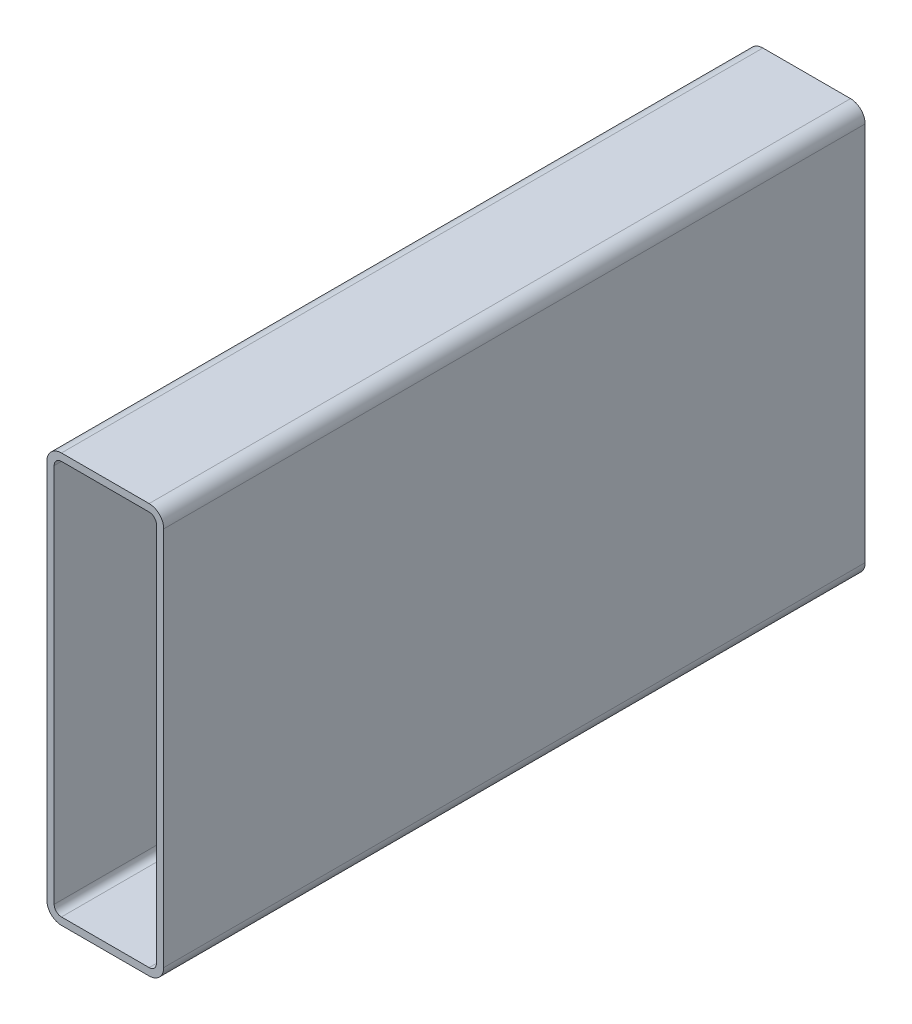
from build123d import *

# Parameters (mm, degrees)
BOSS_EXTRUDE1_DEPTH = 304.8


with BuildPart() as part:
    # Sketch1 → Boss-Extrude1 (new body)
    with BuildSketch(Plane.XY):
        with BuildLine():
            Line((6.35, 177.8), (44.45, 177.8))
            ThreePointArc((44.45, 177.8), (48.940128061, 175.940128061), (50.8, 171.45))
            Line((50.8, 171.45), (50.8, 6.35))
            ThreePointArc((50.8, 6.35), (48.940128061, 1.859871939), (44.45, 0))
            Line((44.45, 0), (6.35, 0))
            ThreePointArc((6.35, 0), (1.859871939, 1.859871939), (0, 6.35))
            Line((0, 6.35), (0, 171.45))
            ThreePointArc((0, 171.45), (1.859871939, 175.940128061), (6.35, 177.8))
        make_face()
        with BuildLine():
            Line((6.35, 174.625), (44.45, 174.625))
            ThreePointArc((44.45, 174.625), (46.69506403, 173.69506403), (47.625, 171.45))
            Line((47.625, 171.45), (47.625, 6.35))
            ThreePointArc((47.625, 6.35), (46.69506403, 4.10493597), (44.45, 3.175))
            Line((44.45, 3.175), (6.35, 3.175))
            ThreePointArc((6.35, 3.175), (4.10493597, 4.10493597), (3.175, 6.35))
            Line((3.175, 6.35), (3.175, 171.45))
            ThreePointArc((3.175, 171.45), (4.10493597, 173.69506403), (6.35, 174.625))
        make_face(mode=Mode.SUBTRACT)
    extrude(amount=BOSS_EXTRUDE1_DEPTH)


solid = part.part
